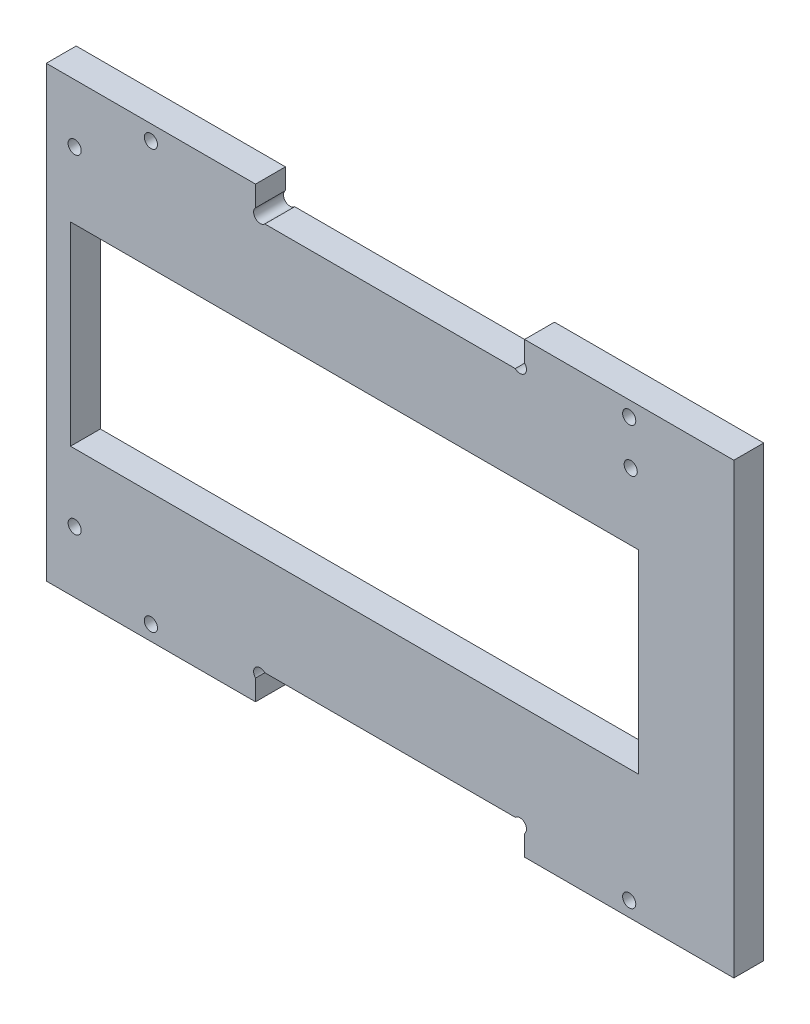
from build123d import *

# Parameters (mm, degrees)
ESQUISSE1_W               = 115
ESQUISSE1_H               = 75
BOSS_EXTRU_1_DEPTH        = 5
ENL_V_MAT_EXTRU_1_REACH   = 139.386
ESQUISSE2_W               = 95
ESQUISSE2_H               = 32.5
ENL_V_MAT_EXTRU_2_REACH   = 139.386
ESQUISSE3_R               = 1.1
ENL_V_MAT_EXTRU_4_REACH   = 139.386
ESQUISSE5_W               = 45
ESQUISSE5_H               = 5
ENL_V_START               = -5
ESQUISSE6_R               = 1.1
ENL_V_MAT_EXTRU_5_DEPTH   = 5
ESQUISSE7_W               = 40
ESQUISSE7_H               = 6
ENL_V_MAT_EXTRU_6_DEPTH   = 1
ENL_V_MAT_EXTRU_7_REACH   = 139.386
ESQUISSE8_R               = 1.1
SYM_TRIE2_COPY_1_REACH    = 139.386
SYM_TRIE2_COPY_1_SKETCH_R = 1.1


with BuildPart() as part:
    # Esquisse1 → Boss.-Extru.1 (new body)
    with BuildSketch(Plane.XY):
        with Locations((57.5, 37.5)):
            Rectangle(ESQUISSE1_W, ESQUISSE1_H)
    extrude(amount=BOSS_EXTRU_1_DEPTH)

    # Esquisse2 → Enl_v. mat.-Extru.1 (cut, up to next)
    with BuildSketch(Plane.XY.offset(5), mode=Mode.PRIVATE) as enl_v_mat_extru_1_sk1:
        with Locations((51.55, 37.8)):
            Rectangle(ESQUISSE2_W, ESQUISSE2_H)
    enl_v_mat_extru_1_tool1 = extrude(enl_v_mat_extru_1_sk1.sketch, amount=-ENL_V_MAT_EXTRU_1_REACH, mode=Mode.PRIVATE) & part.part
    add(enl_v_mat_extru_1_tool1.solids().sort_by_distance((51.55, 37.8, 5))[0], mode=Mode.SUBTRACT)

    # Esquisse3 → Enl_v. mat.-Extru.2 (cut, up to next)
    with BuildSketch(Plane.XY.offset(5), mode=Mode.PRIVATE) as enl_v_mat_extru_2_sk1:
        with Locations((4.75, 65.25)):
            Circle(ESQUISSE3_R)
    enl_v_mat_extru_2_tool1 = extrude(enl_v_mat_extru_2_sk1.sketch, amount=-ENL_V_MAT_EXTRU_2_REACH, mode=Mode.PRIVATE) & part.part
    # Esquisse3 → Enl_v. mat.-Extru.2 (cut, up to next)
    with BuildSketch(Plane.XY.offset(5), mode=Mode.PRIVATE) as enl_v_mat_extru_2_sk2:
        with Locations((97.75, 65.25)):
            Circle(ESQUISSE3_R)
    enl_v_mat_extru_2_tool2 = extrude(enl_v_mat_extru_2_sk2.sketch, amount=-ENL_V_MAT_EXTRU_2_REACH, mode=Mode.PRIVATE) & part.part
    # Esquisse3 → Enl_v. mat.-Extru.2 (cut, up to next)
    with BuildSketch(Plane.XY.offset(5), mode=Mode.PRIVATE) as enl_v_mat_extru_2_sk3:
        with Locations((4.75, 10.25)):
            Circle(ESQUISSE3_R)
    enl_v_mat_extru_2_tool3 = extrude(enl_v_mat_extru_2_sk3.sketch, amount=-ENL_V_MAT_EXTRU_2_REACH, mode=Mode.PRIVATE) & part.part
    add(enl_v_mat_extru_2_tool1.solids().sort_by_distance((4.75, 65.25, 5))[0], mode=Mode.SUBTRACT)
    add(enl_v_mat_extru_2_tool2.solids().sort_by_distance((97.75, 65.25, 5))[0], mode=Mode.SUBTRACT)
    add(enl_v_mat_extru_2_tool3.solids().sort_by_distance((4.75, 10.25, 5))[0], mode=Mode.SUBTRACT)

    # Esquisse5 → Enl_v. mat.-Extru.4 (cut, up to next)
    with BuildSketch(Plane.XY.offset(5), mode=Mode.PRIVATE) as enl_v_mat_extru_4_sk1:
        with Locations((57.5, 72.5)):
            Rectangle(ESQUISSE5_W, ESQUISSE5_H)
    enl_v_mat_extru_4_tool1 = extrude(enl_v_mat_extru_4_sk1.sketch, amount=-ENL_V_MAT_EXTRU_4_REACH, mode=Mode.PRIVATE) & part.part
    # Esquisse5 → Enl_v. mat.-Extru.4 (cut, up to next)
    with BuildSketch(Plane.XY.offset(5), mode=Mode.PRIVATE) as enl_v_mat_extru_4_sk2:
        with Locations((57.5, 2.5)):
            Rectangle(ESQUISSE5_W, ESQUISSE5_H)
    enl_v_mat_extru_4_tool2 = extrude(enl_v_mat_extru_4_sk2.sketch, amount=-ENL_V_MAT_EXTRU_4_REACH, mode=Mode.PRIVATE) & part.part
    add(enl_v_mat_extru_4_tool1.solids().sort_by_distance((57.5, 72.5, 5))[0], mode=Mode.SUBTRACT)
    add(enl_v_mat_extru_4_tool2.solids().sort_by_distance((57.5, 2.5, 5))[0], mode=Mode.SUBTRACT)

    # Esquisse6 → Enl_v. mat.-Extru.5 (cut)
    with BuildSketch(Plane.XY.offset(5).offset(ENL_V_START)):
        with Locations((35.777817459, 70.777817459)):
            Circle(ESQUISSE6_R)
        with Locations((79.222182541, 70.777817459)):
            Circle(ESQUISSE6_R)
        with Locations((35.777817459, 4.222182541)):
            Circle(ESQUISSE6_R)
        with Locations((79.222182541, 4.222182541)):
            Circle(ESQUISSE6_R)
    extrude(amount=ENL_V_MAT_EXTRU_5_DEPTH, mode=Mode.SUBTRACT)

    # Esquisse7 → Enl_v. mat.-Extru.6 (cut)
    with BuildSketch(Plane(origin=(0, 0, 0), x_dir=(-1, 0, 0), z_dir=(0, 0, -1))):
        with Locations((-72.75, 10.5)):
            Rectangle(ESQUISSE7_W, ESQUISSE7_H)
    extrude(amount=-ENL_V_MAT_EXTRU_6_DEPTH, mode=Mode.SUBTRACT)

    # Esquisse8 → Enl_v. mat.-Extru.7 (cut, up to next)
    with BuildSketch(Plane.XY.offset(5), mode=Mode.PRIVATE) as enl_v_mat_extru_7_sk1:
        with Locations((97.5, 72.5)):
            Circle(ESQUISSE8_R)
    enl_v_mat_extru_7_tool1 = extrude(enl_v_mat_extru_7_sk1.sketch, amount=-ENL_V_MAT_EXTRU_7_REACH, mode=Mode.PRIVATE) & part.part
    enl_v_mat_extru_7 = enl_v_mat_extru_7_tool1.solids().sort_by_distance((97.5, 72.5, 5))[0]
    add(enl_v_mat_extru_7, mode=Mode.SUBTRACT)

    # Sym_trie1: Enl_v. mat.-Extru.7 across plane
    add(enl_v_mat_extru_7.mirror(Plane.ZY.offset(-57.5)), mode=Mode.SUBTRACT)

    # Sym_trie2: Enl_v. mat.-Extru.7 across plane
    add(enl_v_mat_extru_7.mirror(Plane.ZX.offset(37.5)), mode=Mode.SUBTRACT)

    # Sym_trie2 copy 1 sketch → Sym_trie2 copy 1 (cut, up to next)
    with BuildSketch(Plane(origin=(115, 75, 5), x_dir=(-1, 0, 0), z_dir=(0, 0, 1)), mode=Mode.PRIVATE) as sym_trie2_copy_1_sk1:
        with Locations((97.5, 72.5)):
            Circle(SYM_TRIE2_COPY_1_SKETCH_R)
    sym_trie2_copy_1_tool1 = extrude(sym_trie2_copy_1_sk1.sketch, amount=-SYM_TRIE2_COPY_1_REACH, mode=Mode.PRIVATE) & part.part
    add(sym_trie2_copy_1_tool1.solids().sort_by_distance((17.5, 2.5, 5))[0], mode=Mode.SUBTRACT)


solid = part.part
